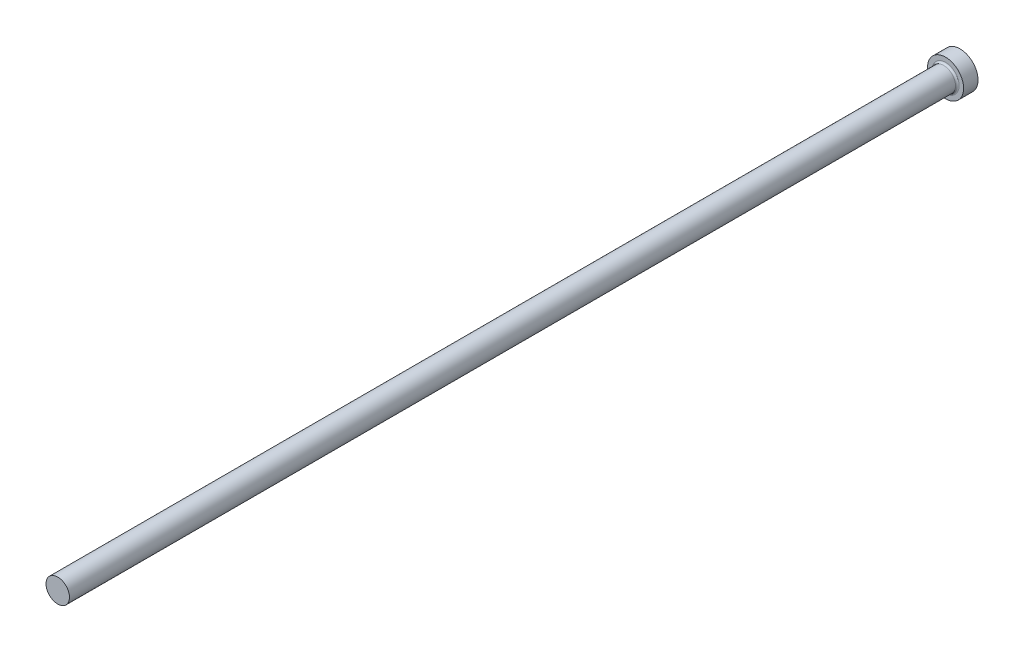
from build123d import *

# Parameters (mm, degrees)
FILLET1_R = 0.5


with BuildPart() as part:
    # FV → Revolve1 (revolve)
    with BuildSketch(Plane(origin=(0, 0, 0), x_dir=(1, 0, 0), z_dir=(0, 1, 0)), mode=Mode.PRIVATE) as revolve1_sk:
        Polygon((0, 0), (5, 0), (5, -4), (3.25, -4), (3.25, -250), (0, -250), align=None)
    revolve(revolve1_sk.sketch.rotate(Axis((0, 0, -9.033228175), (0, 0, 1)), 180), axis=Axis((0, 0, -9.033228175), (0, 0, 1)))

    # Fillet1
    fillet1_edges = [part.edges().sort_by_distance(p)[0] for p in [
        (3.25, 0, 4),
    ]]
    fillet(fillet1_edges, radius=FILLET1_R)


solid = part.part
